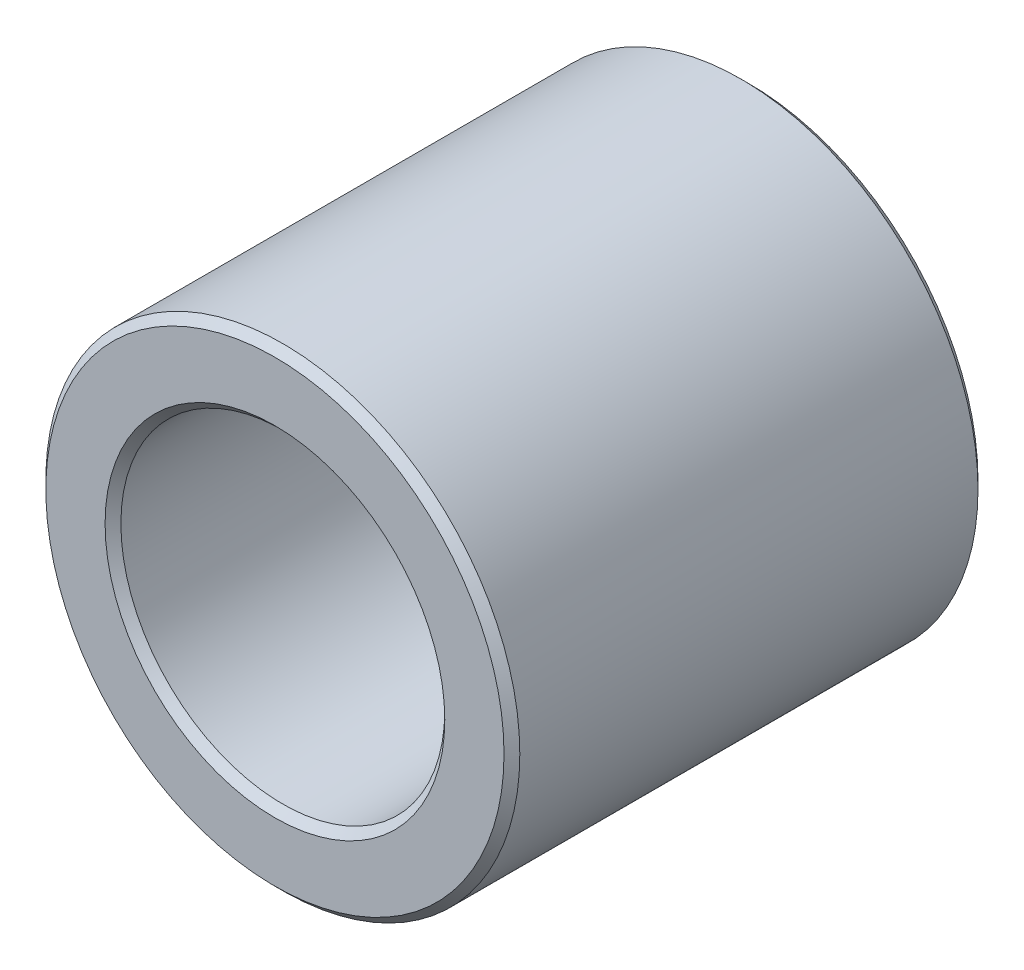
ISO-10303-21;
HEADER;
FILE_DESCRIPTION(('STEP AP214'),'2;1');
FILE_NAME('part.step','',(''),(''),'','','');
FILE_SCHEMA(('AUTOMOTIVE_DESIGN { 1 0 10303 214 1 1 1 1 }'));
ENDSEC;
DATA;
#1=APPLICATION_CONTEXT('core data for automotive mechanical design processes');
#2=APPLICATION_PROTOCOL_DEFINITION('international standard','automotive_design',2000,#1);
#3=PRODUCT_CONTEXT('',#1,'mechanical');
#4=PRODUCT('Part','Part','',(#3));
#5=PRODUCT_RELATED_PRODUCT_CATEGORY('part','',(#4));
#6=PRODUCT_DEFINITION_FORMATION('','',#4);
#7=PRODUCT_DEFINITION_CONTEXT('part definition',#1,'design');
#8=PRODUCT_DEFINITION('design','',#6,#7);
#9=PRODUCT_DEFINITION_SHAPE('','',#8);
#10=(LENGTH_UNIT() NAMED_UNIT(*) SI_UNIT(.MILLI.,.METRE.));
#11=(NAMED_UNIT(*) PLANE_ANGLE_UNIT() SI_UNIT($,.RADIAN.));
#12=(NAMED_UNIT(*) SI_UNIT($,.STERADIAN.) SOLID_ANGLE_UNIT());
#13=UNCERTAINTY_MEASURE_WITH_UNIT(LENGTH_MEASURE(1.E-05),#10,'distance_accuracy_value','');
#14=(GEOMETRIC_REPRESENTATION_CONTEXT(3) GLOBAL_UNCERTAINTY_ASSIGNED_CONTEXT((#13)) GLOBAL_UNIT_ASSIGNED_CONTEXT((#10,
#11,#12)) REPRESENTATION_CONTEXT('',''));
#15=CARTESIAN_POINT('',(0.,0.,0.));
#16=DIRECTION('',(0.,0.,1.));
#17=DIRECTION('',(1.,0.,0.));
#18=AXIS2_PLACEMENT_3D('',#15,#16,#17);
#19=CARTESIAN_POINT('',(0.,0.,6.));
#20=DIRECTION('',(0.,0.,1.));
#21=DIRECTION('',(1.,0.,0.));
#22=AXIS2_PLACEMENT_3D('',#19,#20,#21);
#23=PLANE('',#22);
#24=CARTESIAN_POINT('',(0.,0.,6.));
#25=DIRECTION('',(0.,0.,1.));
#26=DIRECTION('',(1.,0.,0.));
#27=AXIS2_PLACEMENT_3D('',#24,#25,#26);
#28=CIRCLE('',#27,4.3);
#29=CARTESIAN_POINT('',(4.3,0.,6.));
#30=VERTEX_POINT('',#29);
#31=EDGE_CURVE('E10',#30,#30,#28,.F.);
#32=ORIENTED_EDGE('',*,*,#31,.T.);
#33=EDGE_LOOP('',(#32));
#34=FACE_BOUND('',#33,.T.);
#35=CARTESIAN_POINT('',(0.,0.,6.));
#36=DIRECTION('',(0.,0.,1.));
#37=DIRECTION('',(1.,0.,0.));
#38=AXIS2_PLACEMENT_3D('',#35,#36,#37);
#39=CIRCLE('',#38,5.80000000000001);
#40=CARTESIAN_POINT('',(5.80000000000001,0.,6.));
#41=VERTEX_POINT('',#40);
#42=EDGE_CURVE('E45',#41,#41,#39,.T.);
#43=ORIENTED_EDGE('',*,*,#42,.T.);
#44=EDGE_LOOP('',(#43));
#45=FACE_BOUND('',#44,.T.);
#46=ADVANCED_FACE('F37',(#34,#45),#23,.T.);
#47=CARTESIAN_POINT('',(0.,0.,-6.));
#48=DIRECTION('',(0.,0.,1.));
#49=DIRECTION('',(1.,0.,0.));
#50=AXIS2_PLACEMENT_3D('',#47,#48,#49);
#51=PLANE('',#50);
#52=CARTESIAN_POINT('',(0.,0.,-6.));
#53=DIRECTION('',(0.,0.,1.));
#54=DIRECTION('',(1.,0.,0.));
#55=AXIS2_PLACEMENT_3D('',#52,#53,#54);
#56=CIRCLE('',#55,5.8);
#57=CARTESIAN_POINT('',(5.8,0.,-6.));
#58=VERTEX_POINT('',#57);
#59=EDGE_CURVE('E62',#58,#58,#56,.F.);
#60=ORIENTED_EDGE('',*,*,#59,.T.);
#61=EDGE_LOOP('',(#60));
#62=FACE_BOUND('',#61,.T.);
#63=CARTESIAN_POINT('',(0.,0.,-6.));
#64=DIRECTION('',(0.,0.,1.));
#65=DIRECTION('',(1.,0.,0.));
#66=AXIS2_PLACEMENT_3D('',#63,#64,#65);
#67=CIRCLE('',#66,4.3);
#68=CARTESIAN_POINT('',(4.3,0.,-6.));
#69=VERTEX_POINT('',#68);
#70=EDGE_CURVE('E65',#69,#69,#67,.T.);
#71=ORIENTED_EDGE('',*,*,#70,.T.);
#72=EDGE_LOOP('',(#71));
#73=FACE_BOUND('',#72,.T.);
#74=ADVANCED_FACE('F89',(#62,#73),#51,.F.);
#75=CARTESIAN_POINT('',(0.,0.,6.));
#76=DIRECTION('',(0.,0.,-1.));
#77=DIRECTION('',(-1.,0.,0.));
#78=AXIS2_PLACEMENT_3D('',#75,#76,#77);
#79=CYLINDRICAL_SURFACE('',#78,6.);
#80=CARTESIAN_POINT('',(0.,0.,-5.80000000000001));
#81=DIRECTION('',(0.,0.,1.));
#82=DIRECTION('',(1.,0.,0.));
#83=AXIS2_PLACEMENT_3D('',#80,#81,#82);
#84=CIRCLE('',#83,6.);
#85=CARTESIAN_POINT('',(6.,0.,-5.80000000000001));
#86=VERTEX_POINT('',#85);
#87=EDGE_CURVE('E69',#86,#86,#84,.T.);
#88=ORIENTED_EDGE('',*,*,#87,.T.);
#89=EDGE_LOOP('',(#88));
#90=FACE_BOUND('',#89,.T.);
#91=CARTESIAN_POINT('',(0.,0.,5.80000000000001));
#92=DIRECTION('',(0.,0.,1.));
#93=DIRECTION('',(1.,0.,0.));
#94=AXIS2_PLACEMENT_3D('',#91,#92,#93);
#95=CIRCLE('',#94,6.);
#96=CARTESIAN_POINT('',(6.,0.,5.80000000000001));
#97=VERTEX_POINT('',#96);
#98=EDGE_CURVE('E73',#97,#97,#95,.F.);
#99=ORIENTED_EDGE('',*,*,#98,.T.);
#100=EDGE_LOOP('',(#99));
#101=FACE_BOUND('',#100,.T.);
#102=ADVANCED_FACE('F78',(#90,#101),#79,.T.);
#103=CARTESIAN_POINT('',(0.,0.,6.));
#104=DIRECTION('',(0.,0.,-1.));
#105=DIRECTION('',(-1.,0.,0.));
#106=AXIS2_PLACEMENT_3D('',#103,#104,#105);
#107=CYLINDRICAL_SURFACE('',#106,4.1);
#108=CARTESIAN_POINT('',(0.,0.,-5.8));
#109=DIRECTION('',(0.,0.,1.));
#110=DIRECTION('',(1.,0.,0.));
#111=AXIS2_PLACEMENT_3D('',#108,#109,#110);
#112=CIRCLE('',#111,4.1);
#113=CARTESIAN_POINT('',(4.1,0.,-5.8));
#114=VERTEX_POINT('',#113);
#115=EDGE_CURVE('E52',#114,#114,#112,.F.);
#116=ORIENTED_EDGE('',*,*,#115,.T.);
#117=EDGE_LOOP('',(#116));
#118=FACE_BOUND('',#117,.T.);
#119=CARTESIAN_POINT('',(0.,0.,5.8));
#120=DIRECTION('',(0.,0.,1.));
#121=DIRECTION('',(1.,0.,0.));
#122=AXIS2_PLACEMENT_3D('',#119,#120,#121);
#123=CIRCLE('',#122,4.1);
#124=CARTESIAN_POINT('',(4.1,0.,5.8));
#125=VERTEX_POINT('',#124);
#126=EDGE_CURVE('E57',#125,#125,#123,.T.);
#127=ORIENTED_EDGE('',*,*,#126,.T.);
#128=EDGE_LOOP('',(#127));
#129=FACE_BOUND('',#128,.T.);
#130=ADVANCED_FACE('F97',(#118,#129),#107,.F.);
#131=CARTESIAN_POINT('',(0.,0.,-5.80000000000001));
#132=DIRECTION('',(0.,0.,1.));
#133=DIRECTION('',(1.,0.,0.));
#134=AXIS2_PLACEMENT_3D('',#131,#132,#133);
#135=CONICAL_SURFACE('',#134,6.,0.785398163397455);
#136=ORIENTED_EDGE('',*,*,#59,.F.);
#137=EDGE_LOOP('',(#136));
#138=FACE_BOUND('',#137,.T.);
#139=ORIENTED_EDGE('',*,*,#87,.F.);
#140=EDGE_LOOP('',(#139));
#141=FACE_BOUND('',#140,.T.);
#142=ADVANCED_FACE('F102',(#138,#141),#135,.T.);
#143=CARTESIAN_POINT('',(0.,0.,-6.));
#144=DIRECTION('',(0.,0.,-1.));
#145=DIRECTION('',(-1.,0.,0.));
#146=AXIS2_PLACEMENT_3D('',#143,#144,#145);
#147=CONICAL_SURFACE('',#146,4.3,0.785398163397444);
#148=ORIENTED_EDGE('',*,*,#115,.F.);
#149=EDGE_LOOP('',(#148));
#150=FACE_BOUND('',#149,.T.);
#151=ORIENTED_EDGE('',*,*,#70,.F.);
#152=EDGE_LOOP('',(#151));
#153=FACE_BOUND('',#152,.T.);
#154=ADVANCED_FACE('F86',(#150,#153),#147,.F.);
#155=CARTESIAN_POINT('',(0.,0.,5.8));
#156=DIRECTION('',(0.,0.,1.));
#157=DIRECTION('',(1.,0.,0.));
#158=AXIS2_PLACEMENT_3D('',#155,#156,#157);
#159=CONICAL_SURFACE('',#158,4.1,0.785398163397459);
#160=ORIENTED_EDGE('',*,*,#31,.F.);
#161=EDGE_LOOP('',(#160));
#162=FACE_BOUND('',#161,.T.);
#163=ORIENTED_EDGE('',*,*,#126,.F.);
#164=EDGE_LOOP('',(#163));
#165=FACE_BOUND('',#164,.T.);
#166=ADVANCED_FACE('F82',(#162,#165),#159,.F.);
#167=CARTESIAN_POINT('',(0.,0.,6.));
#168=DIRECTION('',(0.,0.,-1.));
#169=DIRECTION('',(-1.,0.,0.));
#170=AXIS2_PLACEMENT_3D('',#167,#168,#169);
#171=CONICAL_SURFACE('',#170,5.80000000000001,0.785398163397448);
#172=ORIENTED_EDGE('',*,*,#98,.F.);
#173=EDGE_LOOP('',(#172));
#174=FACE_BOUND('',#173,.T.);
#175=ORIENTED_EDGE('',*,*,#42,.F.);
#176=EDGE_LOOP('',(#175));
#177=FACE_BOUND('',#176,.T.);
#178=ADVANCED_FACE('F39',(#174,#177),#171,.T.);
#179=CLOSED_SHELL('',(#46,#74,#102,#130,#142,#154,#166,#178));
#180=MANIFOLD_SOLID_BREP('B2',#179);
#181=ADVANCED_BREP_SHAPE_REPRESENTATION('',(#18,#180),#14);
#182=SHAPE_DEFINITION_REPRESENTATION(#9,#181);
ENDSEC;
END-ISO-10303-21;
